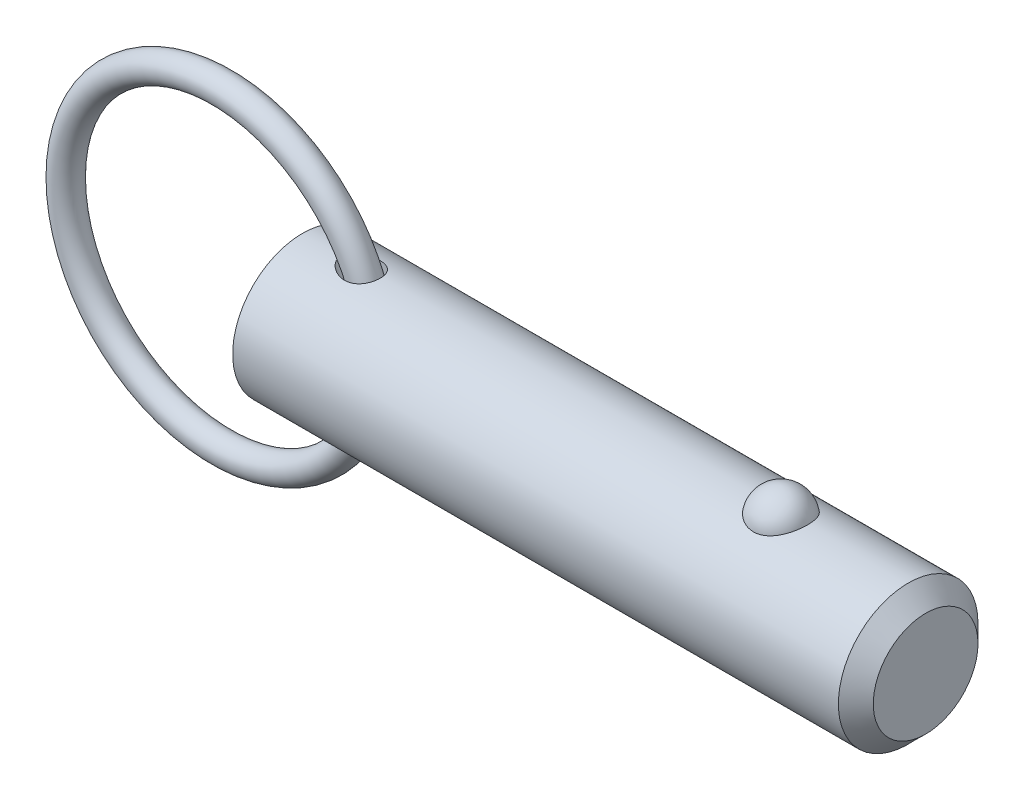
ISO-10303-21;
HEADER;
FILE_DESCRIPTION(('STEP AP214'),'2;1');
FILE_NAME('part.step','',(''),(''),'','','');
FILE_SCHEMA(('AUTOMOTIVE_DESIGN { 1 0 10303 214 1 1 1 1 }'));
ENDSEC;
DATA;
#1=APPLICATION_CONTEXT('core data for automotive mechanical design processes');
#2=APPLICATION_PROTOCOL_DEFINITION('international standard','automotive_design',2000,#1);
#3=PRODUCT_CONTEXT('',#1,'mechanical');
#4=PRODUCT('Part','Part','',(#3));
#5=PRODUCT_RELATED_PRODUCT_CATEGORY('part','',(#4));
#6=PRODUCT_DEFINITION_FORMATION('','',#4);
#7=PRODUCT_DEFINITION_CONTEXT('part definition',#1,'design');
#8=PRODUCT_DEFINITION('design','',#6,#7);
#9=PRODUCT_DEFINITION_SHAPE('','',#8);
#10=(LENGTH_UNIT() NAMED_UNIT(*) SI_UNIT(.MILLI.,.METRE.));
#11=(NAMED_UNIT(*) PLANE_ANGLE_UNIT() SI_UNIT($,.RADIAN.));
#12=(NAMED_UNIT(*) SI_UNIT($,.STERADIAN.) SOLID_ANGLE_UNIT());
#13=UNCERTAINTY_MEASURE_WITH_UNIT(LENGTH_MEASURE(1.E-05),#10,'distance_accuracy_value','');
#14=(GEOMETRIC_REPRESENTATION_CONTEXT(3) GLOBAL_UNCERTAINTY_ASSIGNED_CONTEXT((#13)) GLOBAL_UNIT_ASSIGNED_CONTEXT((#10,
#11,#12)) REPRESENTATION_CONTEXT('',''));
#15=CARTESIAN_POINT('',(0.,0.,0.));
#16=DIRECTION('',(0.,0.,1.));
#17=DIRECTION('',(1.,0.,0.));
#18=AXIS2_PLACEMENT_3D('',#15,#16,#17);
#19=CARTESIAN_POINT('',(-8.23730968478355,0.,0.));
#20=DIRECTION('',(0.,0.,1.));
#21=DIRECTION('',(1.,0.,0.));
#22=AXIS2_PLACEMENT_3D('',#19,#20,#21);
#23=TOROIDAL_SURFACE('',#22,15.875,1.422);
#24=CARTESIAN_POINT('',(9.05969031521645,0.,0.));
#25=VERTEX_POINT('',#24);
#26=VERTEX_LOOP('',#25);
#27=FACE_BOUND('',#26,.T.);
#28=ADVANCED_FACE('P0_F12',(#27),#23,.T.);
#29=CLOSED_SHELL('',(#28));
#30=MANIFOLD_SOLID_BREP('P0_B1',#29);
#31=CARTESIAN_POINT('',(0.,0.,0.));
#32=DIRECTION('',(1.,0.,0.));
#33=DIRECTION('',(0.,0.,-1.));
#34=AXIS2_PLACEMENT_3D('',#31,#32,#33);
#35=CYLINDRICAL_SURFACE('',#34,7.11);
#36=CARTESIAN_POINT('',(3.98467340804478,7.10072679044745,-0.363013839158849));
#37=CARTESIAN_POINT('',(4.00971652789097,7.09600153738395,-0.45539194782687));
#38=CARTESIAN_POINT('',(4.04401947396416,7.08958406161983,-0.545230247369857));
#39=CARTESIAN_POINT('',(4.12810160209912,7.07427055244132,-0.717157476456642));
#40=CARTESIAN_POINT('',(4.17791765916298,7.06536861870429,-0.799227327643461));
#41=CARTESIAN_POINT('',(4.28924471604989,7.04620300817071,-0.953469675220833));
#42=CARTESIAN_POINT('',(4.35063580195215,7.035953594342,-1.02573162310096));
#43=CARTESIAN_POINT('',(4.48282610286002,7.01493313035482,-1.16081412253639));
#44=CARTESIAN_POINT('',(4.55362244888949,7.00416223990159,-1.22363754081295));
#45=CARTESIAN_POINT('',(4.71659336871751,6.98090398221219,-1.35055080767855));
#46=CARTESIAN_POINT('',(4.81029272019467,6.96847103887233,-1.41269256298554));
#47=CARTESIAN_POINT('',(5.0057240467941,6.94515366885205,-1.52319699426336));
#48=CARTESIAN_POINT('',(5.10746392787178,6.93427079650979,-1.57154588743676));
#49=CARTESIAN_POINT('',(5.33503739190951,6.91346066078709,-1.66091325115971));
#50=CARTESIAN_POINT('',(5.46199550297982,6.90402388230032,-1.69921932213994));
#51=CARTESIAN_POINT('',(5.72084799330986,6.89024030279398,-1.75428261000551));
#52=CARTESIAN_POINT('',(5.85274301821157,6.88589416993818,-1.77103699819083));
#53=CARTESIAN_POINT('',(6.11557710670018,6.88337277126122,-1.78081990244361));
#54=CARTESIAN_POINT('',(6.24650031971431,6.88510489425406,-1.77420448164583));
#55=CARTESIAN_POINT('',(6.50446311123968,6.89478744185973,-1.73620392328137));
#56=CARTESIAN_POINT('',(6.6315075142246,6.90272978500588,-1.70485097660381));
#57=CARTESIAN_POINT('',(6.85933269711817,6.92243075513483,-1.62281888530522));
#58=CARTESIAN_POINT('',(6.96133251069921,6.93352131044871,-1.5753580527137));
#59=CARTESIAN_POINT('',(7.15436649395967,6.95824811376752,-1.46226310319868));
#60=CARTESIAN_POINT('',(7.24540699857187,6.97188287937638,-1.3966395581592));
#61=CARTESIAN_POINT('',(7.40446019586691,6.99838217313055,-1.25668991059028));
#62=CARTESIAN_POINT('',(7.473875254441,7.01118308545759,-1.18393777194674));
#63=CARTESIAN_POINT('',(7.59904891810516,7.03582803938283,-1.02736918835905));
#64=CARTESIAN_POINT('',(7.65481029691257,7.04767227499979,-0.943554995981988));
#65=CARTESIAN_POINT('',(7.74982438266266,7.06873077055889,-0.76979592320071));
#66=CARTESIAN_POINT('',(7.7894903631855,7.07800861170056,-0.680084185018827));
#67=CARTESIAN_POINT('',(7.85354088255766,7.09334756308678,-0.495102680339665));
#68=CARTESIAN_POINT('',(7.87792559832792,7.09940871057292,-0.399832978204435));
#69=CARTESIAN_POINT('',(7.9108898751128,7.10766731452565,-0.206294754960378));
#70=CARTESIAN_POINT('',(7.91944662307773,7.10985919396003,-0.108022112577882));
#71=CARTESIAN_POINT('',(7.920501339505,7.11012756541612,0.0886168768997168));
#72=CARTESIAN_POINT('',(7.91299895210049,7.10820396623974,0.186983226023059));
#73=CARTESIAN_POINT('',(7.88205794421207,7.10043733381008,0.381270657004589));
#74=CARTESIAN_POINT('',(7.85857985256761,7.09458459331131,0.477185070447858));
#75=CARTESIAN_POINT('',(7.79617406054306,7.07958431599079,0.663575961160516));
#76=CARTESIAN_POINT('',(7.75724672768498,7.07043685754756,0.754052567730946));
#77=CARTESIAN_POINT('',(7.66496731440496,7.04987259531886,0.926798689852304));
#78=CARTESIAN_POINT('',(7.61164530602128,7.0384605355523,1.00908483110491));
#79=CARTESIAN_POINT('',(7.49191707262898,7.01461776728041,1.16333092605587));
#80=CARTESIAN_POINT('',(7.42551210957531,7.00218715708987,1.235291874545));
#81=CARTESIAN_POINT('',(7.28164031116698,6.97770944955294,1.36680167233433));
#82=CARTESIAN_POINT('',(7.20420170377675,6.96566146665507,1.42638126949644));
#83=CARTESIAN_POINT('',(7.0403906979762,6.94319963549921,1.53199377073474));
#84=CARTESIAN_POINT('',(6.95401827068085,6.93278579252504,1.57802663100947));
#85=CARTESIAN_POINT('',(6.7731858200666,6.91444459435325,1.65656940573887));
#86=CARTESIAN_POINT('',(6.67860569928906,6.90656682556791,1.68881327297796));
#87=CARTESIAN_POINT('',(6.48544119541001,6.89422806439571,1.73849768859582));
#88=CARTESIAN_POINT('',(6.38685561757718,6.88976809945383,1.755933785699));
#89=CARTESIAN_POINT('',(6.18089829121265,6.88429907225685,1.77726234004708));
#90=CARTESIAN_POINT('',(6.07340937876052,6.88356485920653,1.78007646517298));
#91=CARTESIAN_POINT('',(5.85921220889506,6.886086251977,1.77029087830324));
#92=CARTESIAN_POINT('',(5.75250426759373,6.88934339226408,1.75768523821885));
#93=CARTESIAN_POINT('',(5.52848027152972,6.89994454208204,1.71563399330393));
#94=CARTESIAN_POINT('',(5.41155168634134,6.90775772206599,1.68424184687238));
#95=CARTESIAN_POINT('',(5.18376466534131,6.92670168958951,1.60454711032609));
#96=CARTESIAN_POINT('',(5.07291446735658,6.9378368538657,1.5562221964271));
#97=CARTESIAN_POINT('',(4.84835244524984,6.96347168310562,1.43744827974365));
#98=CARTESIAN_POINT('',(4.73562531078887,6.97820486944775,1.36517310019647));
#99=CARTESIAN_POINT('',(4.52504912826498,7.00822340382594,1.20158053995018));
#100=CARTESIAN_POINT('',(4.42717478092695,7.02350775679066,1.11029618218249));
#101=CARTESIAN_POINT('',(4.27935716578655,7.04784659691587,0.940654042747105));
#102=CARTESIAN_POINT('',(4.2239722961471,7.05736064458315,0.867099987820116));
#103=CARTESIAN_POINT('',(4.12558347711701,7.07469854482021,0.711919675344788));
#104=CARTESIAN_POINT('',(4.08256922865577,7.0825238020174,0.630300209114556));
#105=CARTESIAN_POINT('',(4.01142860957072,7.09565978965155,0.459428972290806));
#106=CARTESIAN_POINT('',(3.98346043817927,7.10094374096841,0.370107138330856));
#107=CARTESIAN_POINT('',(3.95517285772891,7.1063173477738,0.233358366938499));
#108=CARTESIAN_POINT('',(3.94802115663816,7.1076831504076,0.187321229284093));
#109=CARTESIAN_POINT('',(3.93842121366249,7.10951900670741,0.0947476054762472));
#110=CARTESIAN_POINT('',(3.93597129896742,7.10998937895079,0.0482113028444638));
#111=CARTESIAN_POINT('',(3.93584361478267,7.11001358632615,-0.0598597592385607));
#112=CARTESIAN_POINT('',(3.9399538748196,7.10922402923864,-0.121405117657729));
#113=CARTESIAN_POINT('',(3.95632793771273,7.10609781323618,-0.243320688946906));
#114=CARTESIAN_POINT('',(3.96859135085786,7.10376122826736,-0.303690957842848));
#115=CARTESIAN_POINT('',(3.98467340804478,7.10072679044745,-0.363013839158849));
#116=B_SPLINE_CURVE_WITH_KNOTS('',3,(#36,#37,#38,#39,#40,#41,#42,#43,#44,#45,#46,#47,#48,#49,
#50,#51,#52,#53,#54,#55,#56,#57,#58,#59,#60,#61,#62,#63,#64,#65,#66,#67,#68,#69,#70,#71,#72,#73,
#74,#75,#76,#77,#78,#79,#80,#81,#82,#83,#84,#85,#86,#87,#88,#89,#90,#91,#92,#93,#94,#95,#96,#97,
#98,#99,#100,#101,#102,#103,#104,#105,#106,#107,#108,#109,#110,#111,#112,#113,#114,#115),
.UNSPECIFIED.,.T.,.F.,(4,2,2,2,2,2,2,2,2,2,2,2,2,2,2,2,2,2,2,2,2,2,2,2,2,2,2,2,2,2,2,2,2,2,2,2,
2,2,2,4),(0.,0.287206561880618,0.575101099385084,0.860162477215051,1.14513709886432,
1.48324846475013,1.82169652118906,2.21865672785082,2.6156690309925,3.00665870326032,
3.39714041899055,3.73437585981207,4.07141541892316,4.37402271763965,4.67656849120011,
4.97076150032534,5.26495110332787,5.55956439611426,5.85418421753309,6.14953461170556,
6.44487798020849,6.73960905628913,7.03431171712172,7.32827352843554,7.6222362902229,
7.9216396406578,8.22113296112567,8.54242840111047,8.86384740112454,9.22635035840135,
9.58933304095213,9.99153142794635,10.3930368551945,10.6697219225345,10.9461759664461,
11.2254825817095,11.3650959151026,11.5046595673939,11.6891051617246,11.8735419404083),.UNSPECIFIED.);
#117=CARTESIAN_POINT('',(3.98467340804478,7.10072679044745,-0.363013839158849));
#118=VERTEX_POINT('',#117);
#119=EDGE_CURVE('P1_E40',#118,#118,#116,.T.);
#120=ORIENTED_EDGE('',*,*,#119,.T.);
#121=EDGE_LOOP('',(#120));
#122=FACE_BOUND('',#121,.T.);
#123=CARTESIAN_POINT('',(61.6925,0.,0.));
#124=DIRECTION('',(1.,0.,0.));
#125=DIRECTION('',(0.,0.,-1.));
#126=AXIS2_PLACEMENT_3D('',#123,#124,#125);
#127=CIRCLE('',#126,7.11);
#128=CARTESIAN_POINT('',(61.6925,0.,-7.11));
#129=VERTEX_POINT('',#128);
#130=EDGE_CURVE('P1_E25',#129,#129,#127,.T.);
#131=ORIENTED_EDGE('',*,*,#130,.F.);
#132=EDGE_LOOP('',(#131));
#133=FACE_BOUND('',#132,.T.);
#134=CARTESIAN_POINT('',(0.,0.,0.));
#135=DIRECTION('',(1.,0.,0.));
#136=DIRECTION('',(0.,0.,-1.));
#137=AXIS2_PLACEMENT_3D('',#134,#135,#136);
#138=CIRCLE('',#137,7.11);
#139=CARTESIAN_POINT('',(0.,0.,-7.11));
#140=VERTEX_POINT('',#139);
#141=EDGE_CURVE('P1_E9',#140,#140,#138,.T.);
#142=ORIENTED_EDGE('',*,*,#141,.T.);
#143=EDGE_LOOP('',(#142));
#144=FACE_BOUND('',#143,.T.);
#145=CARTESIAN_POINT('',(48.729258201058,6.5364666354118,2.79762469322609));
#146=CARTESIAN_POINT('',(48.5844296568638,6.53647876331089,2.79761243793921));
#147=CARTESIAN_POINT('',(48.439368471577,6.54144531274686,2.78608115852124));
#148=CARTESIAN_POINT('',(48.1532920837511,6.56077791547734,2.7402328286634));
#149=CARTESIAN_POINT('',(48.0122884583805,6.5751685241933,2.7058562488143));
#150=CARTESIAN_POINT('',(47.7388833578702,6.61165072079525,2.61544042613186));
#151=CARTESIAN_POINT('',(47.6064602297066,6.63372195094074,2.55945840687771));
#152=CARTESIAN_POINT('',(47.3532337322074,6.68316012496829,2.42742958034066));
#153=CARTESIAN_POINT('',(47.2324254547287,6.71052481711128,2.35139129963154));
#154=CARTESIAN_POINT('',(47.0016372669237,6.76860821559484,2.17866150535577));
#155=CARTESIAN_POINT('',(46.8920857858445,6.79940242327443,2.08142342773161));
#156=CARTESIAN_POINT('',(46.6903340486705,6.86050242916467,1.87020907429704));
#157=CARTESIAN_POINT('',(46.5981390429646,6.89080807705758,1.75622775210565));
#158=CARTESIAN_POINT('',(46.4292547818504,6.94923069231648,1.50900646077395));
#159=CARTESIAN_POINT('',(46.3534289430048,6.97719213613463,1.37513873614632));
#160=CARTESIAN_POINT('',(46.2242063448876,7.02647251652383,1.09584817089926));
#161=CARTESIAN_POINT('',(46.1708109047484,7.04779106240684,0.950424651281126));
#162=CARTESIAN_POINT('',(46.0871019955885,7.08180248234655,0.650508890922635));
#163=CARTESIAN_POINT('',(46.0570253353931,7.09440672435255,0.49594033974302));
#164=CARTESIAN_POINT('',(46.0214735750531,7.10935121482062,0.183515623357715));
#165=CARTESIAN_POINT('',(46.0159974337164,7.11169189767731,0.0256595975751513));
#166=CARTESIAN_POINT('',(46.029700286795,7.10589702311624,-0.287512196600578));
#167=CARTESIAN_POINT('',(46.0486823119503,7.0978451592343,-0.442838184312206));
#168=CARTESIAN_POINT('',(46.1105745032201,7.07221860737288,-0.747830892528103));
#169=CARTESIAN_POINT('',(46.1534850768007,7.05464375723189,-0.897497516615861));
#170=CARTESIAN_POINT('',(46.2624527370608,7.01171031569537,-1.18722864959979));
#171=CARTESIAN_POINT('',(46.3285458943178,6.98633960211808,-1.32727778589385));
#172=CARTESIAN_POINT('',(46.4825362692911,6.93042258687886,-1.59370324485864));
#173=CARTESIAN_POINT('',(46.5704355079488,6.89987580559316,-1.7200782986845));
#174=CARTESIAN_POINT('',(46.7669269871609,6.83659510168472,-1.95657345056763));
#175=CARTESIAN_POINT('',(46.8756640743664,6.80384697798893,-2.06656957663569));
#176=CARTESIAN_POINT('',(47.1109686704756,6.7400183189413,-2.26611005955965));
#177=CARTESIAN_POINT('',(47.2375350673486,6.70893767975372,-2.35565569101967));
#178=CARTESIAN_POINT('',(47.5028454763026,6.65264442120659,-2.51019726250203));
#179=CARTESIAN_POINT('',(47.6413230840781,6.62733449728,-2.57561395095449));
#180=CARTESIAN_POINT('',(47.9285194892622,6.58495995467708,-2.68211134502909));
#181=CARTESIAN_POINT('',(48.0772343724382,6.56789220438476,-2.7232012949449));
#182=CARTESIAN_POINT('',(48.3726268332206,6.54478663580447,-2.77825810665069));
#183=CARTESIAN_POINT('',(48.5190295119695,6.53823639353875,-2.79348727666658));
#184=CARTESIAN_POINT('',(48.8124700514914,6.53532718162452,-2.80028921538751));
#185=CARTESIAN_POINT('',(48.9595077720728,6.53896606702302,-2.79186696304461));
#186=CARTESIAN_POINT('',(49.2449210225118,6.55570357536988,-2.75232178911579));
#187=CARTESIAN_POINT('',(49.3834221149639,6.56848455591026,-2.72196077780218));
#188=CARTESIAN_POINT('',(49.6531142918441,6.60173528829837,-2.64028774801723));
#189=CARTESIAN_POINT('',(49.784304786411,6.62220565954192,-2.58897404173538));
#190=CARTESIAN_POINT('',(50.0388462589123,6.66917927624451,-2.4654782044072));
#191=CARTESIAN_POINT('',(50.1619691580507,6.69580233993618,-2.39287266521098));
#192=CARTESIAN_POINT('',(50.3944418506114,6.75207041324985,-2.2291526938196));
#193=CARTESIAN_POINT('',(50.5037884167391,6.78171612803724,-2.13803393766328));
#194=CARTESIAN_POINT('',(50.711642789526,6.84264629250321,-1.93445592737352));
#195=CARTESIAN_POINT('',(50.8093178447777,6.87393748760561,-1.82114774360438));
#196=CARTESIAN_POINT('',(50.9850112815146,6.93345710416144,-1.57947787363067));
#197=CARTESIAN_POINT('',(51.0630261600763,6.96168497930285,-1.45111351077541));
#198=CARTESIAN_POINT('',(51.1999857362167,7.01307558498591,-1.17842708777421));
#199=CARTESIAN_POINT('',(51.2582588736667,7.03605262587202,-1.03373189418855));
#200=CARTESIAN_POINT('',(51.3510815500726,7.07340932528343,-0.735867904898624));
#201=CARTESIAN_POINT('',(51.3856311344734,7.08778900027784,-0.582699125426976));
#202=CARTESIAN_POINT('',(51.4302742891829,7.10647639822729,-0.272420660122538));
#203=CARTESIAN_POINT('',(51.44039710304,7.11079616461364,-0.115315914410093));
#204=CARTESIAN_POINT('',(51.436061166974,7.10896059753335,0.198488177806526));
#205=CARTESIAN_POINT('',(51.4216031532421,7.10280557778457,0.355187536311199));
#206=CARTESIAN_POINT('',(51.3685727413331,7.08071500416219,0.662724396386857));
#207=CARTESIAN_POINT('',(51.3301505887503,7.06484039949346,0.813592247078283));
#208=CARTESIAN_POINT('',(51.230101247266,7.0249589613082,1.10629159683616));
#209=CARTESIAN_POINT('',(51.1684724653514,7.00095156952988,1.24812247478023));
#210=CARTESIAN_POINT('',(51.0227668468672,6.94706632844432,1.51976439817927));
#211=CARTESIAN_POINT('',(50.9385448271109,6.91715085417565,1.64949012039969));
#212=CARTESIAN_POINT('',(50.7495861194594,6.85470565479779,1.89231285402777));
#213=CARTESIAN_POINT('',(50.6448501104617,6.82217601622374,2.00541041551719));
#214=CARTESIAN_POINT('',(50.4171030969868,6.75805358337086,2.21190674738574));
#215=CARTESIAN_POINT('',(50.294082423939,6.72646129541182,2.30529503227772));
#216=CARTESIAN_POINT('',(50.0327347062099,6.66789520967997,2.46959908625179));
#217=CARTESIAN_POINT('',(49.8944019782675,6.64092313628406,2.54050647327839));
#218=CARTESIAN_POINT('',(49.6111828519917,6.5957258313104,2.65560045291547));
#219=CARTESIAN_POINT('',(49.4666660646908,6.57724013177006,2.70059539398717));
#220=CARTESIAN_POINT('',(49.1715469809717,6.55006426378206,2.76587321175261));
#221=CARTESIAN_POINT('',(49.0209640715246,6.54134511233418,2.78622922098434));
#222=CARTESIAN_POINT('',(48.8230463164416,6.53697847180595,2.7964243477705));
#223=CARTESIAN_POINT('',(48.7761644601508,6.53646270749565,2.79762866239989));
#224=CARTESIAN_POINT('',(48.729258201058,6.5364666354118,2.79762469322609));
#225=B_SPLINE_CURVE_WITH_KNOTS('',3,(#145,#146,#147,#148,#149,#150,#151,#152,#153,#154,#155,
#156,#157,#158,#159,#160,#161,#162,#163,#164,#165,#166,#167,#168,#169,#170,#171,#172,#173,#174,
#175,#176,#177,#178,#179,#180,#181,#182,#183,#184,#185,#186,#187,#188,#189,#190,#191,#192,#193,
#194,#195,#196,#197,#198,#199,#200,#201,#202,#203,#204,#205,#206,#207,#208,#209,#210,#211,#212,
#213,#214,#215,#216,#217,#218,#219,#220,#221,#222,#223,#224),.UNSPECIFIED.,.T.,.F.,(4,2,2,2,2,2,
2,2,2,2,2,2,2,2,2,2,2,2,2,2,2,2,2,2,2,2,2,2,2,2,2,2,2,2,2,2,2,2,2,4),(0.,0.434355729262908,
0.869847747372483,1.30419416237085,1.73835621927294,2.18541922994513,2.63261726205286,
3.09954261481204,3.56649542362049,4.03813031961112,4.50974525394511,4.97758575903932,
5.44543423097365,5.9140138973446,6.38263700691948,6.8546441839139,7.32662193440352,
7.78992971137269,8.25306131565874,8.69285754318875,9.13256119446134,9.55768625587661,
9.9828455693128,10.4171106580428,10.8514772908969,11.3079089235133,11.7644218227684,
12.2351898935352,12.7059570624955,13.1761603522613,13.6463495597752,14.1136200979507,
14.580922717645,15.0513032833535,15.5216682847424,15.9922828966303,16.4630727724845,
16.9182457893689,17.3720644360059,17.5127411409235),.UNSPECIFIED.);
#226=CARTESIAN_POINT('',(48.729258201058,6.5364666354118,2.79762469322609));
#227=VERTEX_POINT('',#226);
#228=EDGE_CURVE('P1_E34',#227,#227,#225,.T.);
#229=ORIENTED_EDGE('',*,*,#228,.T.);
#230=EDGE_LOOP('',(#229));
#231=FACE_BOUND('',#230,.T.);
#232=CARTESIAN_POINT('',(3.98467340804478,-7.10072679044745,-0.363013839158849));
#233=CARTESIAN_POINT('',(3.96426456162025,-7.10457733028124,-0.287714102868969));
#234=CARTESIAN_POINT('',(3.95000501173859,-7.10730349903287,-0.210695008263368));
#235=CARTESIAN_POINT('',(3.93481801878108,-7.11020840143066,-0.0553038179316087));
#236=CARTESIAN_POINT('',(3.93388435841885,-7.11038832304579,0.0230676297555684));
#237=CARTESIAN_POINT('',(3.94541910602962,-7.10817995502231,0.178714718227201));
#238=CARTESIAN_POINT('',(3.95787987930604,-7.10579312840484,0.25599095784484));
#239=CARTESIAN_POINT('',(3.99523775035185,-7.09872642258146,0.407352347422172));
#240=CARTESIAN_POINT('',(4.02014065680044,-7.09404547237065,0.481435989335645));
#241=CARTESIAN_POINT('',(4.08119600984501,-7.08278363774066,0.625775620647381));
#242=CARTESIAN_POINT('',(4.11749458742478,-7.07617815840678,0.695967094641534));
#243=CARTESIAN_POINT('',(4.19940836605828,-7.06165305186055,0.830508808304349));
#244=CARTESIAN_POINT('',(4.24502952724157,-7.0537325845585,0.894855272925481));
#245=CARTESIAN_POINT('',(4.36790232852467,-7.03310314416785,1.04688574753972));
#246=CARTESIAN_POINT('',(4.44977459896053,-7.01993229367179,1.13078695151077));
#247=CARTESIAN_POINT('',(4.62610796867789,-6.99351259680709,1.28411726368));
#248=CARTESIAN_POINT('',(4.7205898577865,-6.98026365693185,1.35352197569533));
#249=CARTESIAN_POINT('',(4.92036507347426,-6.9549104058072,1.47831921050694));
#250=CARTESIAN_POINT('',(5.02579054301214,-6.94282458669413,1.53350332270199));
#251=CARTESIAN_POINT('',(5.24378330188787,-6.92129098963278,1.62793610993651));
#252=CARTESIAN_POINT('',(5.35635066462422,-6.91184323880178,1.66718462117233));
#253=CARTESIAN_POINT('',(5.60134354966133,-6.89573491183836,1.73269893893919));
#254=CARTESIAN_POINT('',(5.73444697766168,-6.8895970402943,1.75661057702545));
#255=CARTESIAN_POINT('',(6.00300738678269,-6.88344616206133,1.78057487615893));
#256=CARTESIAN_POINT('',(6.13846360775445,-6.88343121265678,1.78063510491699));
#257=CARTESIAN_POINT('',(6.39660470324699,-6.88981379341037,1.75576480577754));
#258=CARTESIAN_POINT('',(6.51947843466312,-6.89572457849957,1.73273121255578));
#259=CARTESIAN_POINT('',(6.75813770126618,-6.91274434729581,1.66352936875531));
#260=CARTESIAN_POINT('',(6.87393155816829,-6.92384709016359,1.61738888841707));
#261=CARTESIAN_POINT('',(7.07801861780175,-6.94787316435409,1.51052664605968));
#262=CARTESIAN_POINT('',(7.16789841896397,-6.96033024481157,1.45271574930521));
#263=CARTESIAN_POINT('',(7.33546773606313,-6.98638661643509,1.32171912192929));
#264=CARTESIAN_POINT('',(7.41316182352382,-6.99998547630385,1.24853918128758));
#265=CARTESIAN_POINT('',(7.54861420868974,-7.02559503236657,1.09486170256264));
#266=CARTESIAN_POINT('',(7.60741145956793,-7.03764930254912,1.01528346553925));
#267=CARTESIAN_POINT('',(7.71070740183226,-7.0598657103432,0.847099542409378));
#268=CARTESIAN_POINT('',(7.75520788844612,-7.0700280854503,0.758494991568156));
#269=CARTESIAN_POINT('',(7.82836147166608,-7.08722075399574,0.575936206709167));
#270=CARTESIAN_POINT('',(7.85719783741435,-7.09428707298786,0.482058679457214));
#271=CARTESIAN_POINT('',(7.89918378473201,-7.10470260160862,0.29065874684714));
#272=CARTESIAN_POINT('',(7.91233308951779,-7.10805174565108,0.193136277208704));
#273=CARTESIAN_POINT('',(7.92267451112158,-7.11067890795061,-0.00313968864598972));
#274=CARTESIAN_POINT('',(7.91981203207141,-7.10994299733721,-0.10189624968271));
#275=CARTESIAN_POINT('',(7.89806489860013,-7.10444651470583,-0.297516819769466));
#276=CARTESIAN_POINT('',(7.87918005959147,-7.09968589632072,-0.394380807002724));
#277=CARTESIAN_POINT('',(7.82577988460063,-7.0866471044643,-0.58355375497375));
#278=CARTESIAN_POINT('',(7.79124976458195,-7.07836560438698,-0.675858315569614));
#279=CARTESIAN_POINT('',(7.70736343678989,-7.05919003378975,-0.853167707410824));
#280=CARTESIAN_POINT('',(7.65800801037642,-7.04829610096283,-0.938172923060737));
#281=CARTESIAN_POINT('',(7.54590141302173,-7.02513961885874,-1.09819812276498));
#282=CARTESIAN_POINT('',(7.48319521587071,-7.01288172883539,-1.17325029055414));
#283=CARTESIAN_POINT('',(7.34599775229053,-6.98832192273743,-1.31164333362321));
#284=CARTESIAN_POINT('',(7.27150757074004,-6.97602001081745,-1.37498528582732));
#285=CARTESIAN_POINT('',(7.11277776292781,-6.95268608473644,-1.48849974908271));
#286=CARTESIAN_POINT('',(7.02852525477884,-6.94165578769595,-1.53865456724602));
#287=CARTESIAN_POINT('',(6.85282430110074,-6.92200320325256,-1.62478650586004));
#288=CARTESIAN_POINT('',(6.76137511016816,-6.91338116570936,-1.66076215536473));
#289=CARTESIAN_POINT('',(6.57061179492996,-6.89906044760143,-1.71930563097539));
#290=CARTESIAN_POINT('',(6.47113516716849,-6.89347290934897,-1.74136795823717));
#291=CARTESIAN_POINT('',(6.26989833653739,-6.88605020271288,-1.7704895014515));
#292=CARTESIAN_POINT('',(6.16813737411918,-6.88421630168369,-1.77754365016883));
#293=CARTESIAN_POINT('',(5.95492537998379,-6.88424071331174,-1.77745174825));
#294=CARTESIAN_POINT('',(5.8434768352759,-6.88646827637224,-1.76888555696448));
#295=CARTESIAN_POINT('',(5.62307560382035,-6.89483827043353,-1.73596677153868));
#296=CARTESIAN_POINT('',(5.51412477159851,-6.90098351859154,-1.71160281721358));
#297=CARTESIAN_POINT('',(5.28644478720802,-6.91743803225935,-1.64393691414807));
#298=CARTESIAN_POINT('',(5.16837217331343,-6.92819628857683,-1.59852806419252));
#299=CARTESIAN_POINT('',(4.94091825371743,-6.95234836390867,-1.4899796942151));
#300=CARTESIAN_POINT('',(4.83153887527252,-6.96574276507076,-1.42683625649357));
#301=CARTESIAN_POINT('',(4.63576710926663,-6.99209234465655,-1.29112257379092));
#302=CARTESIAN_POINT('',(4.54816728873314,-7.00494184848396,-1.22027748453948));
#303=CARTESIAN_POINT('',(4.38554897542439,-7.03019055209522,-1.0652111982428));
#304=CARTESIAN_POINT('',(4.31052141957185,-7.04259007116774,-0.980999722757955));
#305=CARTESIAN_POINT('',(4.18551811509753,-7.0640229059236,-0.811206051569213));
#306=CARTESIAN_POINT('',(4.13358417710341,-7.07328321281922,-0.727107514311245));
#307=CARTESIAN_POINT('',(4.04607461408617,-7.0891994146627,-0.550580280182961));
#308=CARTESIAN_POINT('',(4.01046401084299,-7.09586087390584,-0.458169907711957));
#309=CARTESIAN_POINT('',(3.98467340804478,-7.10072679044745,-0.363013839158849));
#310=B_SPLINE_CURVE_WITH_KNOTS('',3,(#232,#233,#234,#235,#236,#237,#238,#239,#240,#241,#242,
#243,#244,#245,#246,#247,#248,#249,#250,#251,#252,#253,#254,#255,#256,#257,#258,#259,#260,#261,
#262,#263,#264,#265,#266,#267,#268,#269,#270,#271,#272,#273,#274,#275,#276,#277,#278,#279,#280,
#281,#282,#283,#284,#285,#286,#287,#288,#289,#290,#291,#292,#293,#294,#295,#296,#297,#298,#299,
#300,#301,#302,#303,#304,#305,#306,#307,#308,#309),.UNSPECIFIED.,.T.,.F.,(4,2,2,2,2,2,2,2,2,2,2,
2,2,2,2,2,2,2,2,2,2,2,2,2,2,2,2,2,2,2,2,2,2,2,2,2,2,2,4),(0.,0.23402065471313,0.467932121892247,
0.701710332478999,0.935597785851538,1.17261620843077,1.40978663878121,1.76177576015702,
2.11435255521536,2.47183528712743,2.8293216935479,3.23332937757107,3.63720887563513,
4.01042610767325,4.38319587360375,4.70425151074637,5.02518641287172,5.32277979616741,
5.62033579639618,5.91433101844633,6.2083314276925,6.50333490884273,6.79834178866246,
7.09362801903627,7.38889868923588,7.6831900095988,7.9774542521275,8.27211131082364,
8.56679892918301,8.8716552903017,9.17661456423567,9.51069129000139,9.84500851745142,
10.2243046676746,10.6036846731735,10.9425776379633,11.2812252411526,11.5775945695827,
11.8733258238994),.UNSPECIFIED.);
#311=CARTESIAN_POINT('',(3.98467340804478,-7.10072679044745,-0.363013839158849));
#312=VERTEX_POINT('',#311);
#313=EDGE_CURVE('P1_E17',#312,#312,#310,.T.);
#314=ORIENTED_EDGE('',*,*,#313,.T.);
#315=EDGE_LOOP('',(#314));
#316=FACE_BOUND('',#315,.T.);
#317=ADVANCED_FACE('P1_F13',(#122,#133,#144,#231,#316),#35,.T.);
#318=CARTESIAN_POINT('',(0.,0.,0.));
#319=DIRECTION('',(-1.,0.,0.));
#320=DIRECTION('',(0.,0.,1.));
#321=AXIS2_PLACEMENT_3D('',#318,#319,#320);
#322=PLANE('',#321);
#323=ORIENTED_EDGE('',*,*,#141,.F.);
#324=EDGE_LOOP('',(#323));
#325=FACE_BOUND('',#324,.T.);
#326=ADVANCED_FACE('P1_F15',(#325),#322,.T.);
#327=CARTESIAN_POINT('',(63.47,0.,0.));
#328=DIRECTION('',(-1.,0.,0.));
#329=DIRECTION('',(0.,0.,1.));
#330=AXIS2_PLACEMENT_3D('',#327,#328,#329);
#331=CONICAL_SURFACE('',#330,5.33250000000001,0.785398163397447);
#332=ORIENTED_EDGE('',*,*,#130,.T.);
#333=EDGE_LOOP('',(#332));
#334=FACE_BOUND('',#333,.T.);
#335=CARTESIAN_POINT('',(63.47,0.,0.));
#336=DIRECTION('',(1.,0.,0.));
#337=DIRECTION('',(0.,0.,-1.));
#338=AXIS2_PLACEMENT_3D('',#335,#336,#337);
#339=CIRCLE('',#338,5.33250000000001);
#340=CARTESIAN_POINT('',(63.47,0.,-5.33250000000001));
#341=VERTEX_POINT('',#340);
#342=EDGE_CURVE('P1_E30',#341,#341,#339,.T.);
#343=ORIENTED_EDGE('',*,*,#342,.F.);
#344=EDGE_LOOP('',(#343));
#345=FACE_BOUND('',#344,.T.);
#346=ADVANCED_FACE('P1_F55',(#334,#345),#331,.T.);
#347=CARTESIAN_POINT('',(63.47,5.33250000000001,0.));
#348=DIRECTION('',(1.,0.,0.));
#349=DIRECTION('',(0.,0.,-1.));
#350=AXIS2_PLACEMENT_3D('',#347,#348,#349);
#351=PLANE('',#350);
#352=ORIENTED_EDGE('',*,*,#342,.T.);
#353=EDGE_LOOP('',(#352));
#354=FACE_BOUND('',#353,.T.);
#355=ADVANCED_FACE('P1_F51',(#354),#351,.T.);
#356=CARTESIAN_POINT('',(48.729258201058,6.399,0.));
#357=DIRECTION('',(-1.,0.,0.));
#358=DIRECTION('',(0.,1.,0.));
#359=AXIS2_PLACEMENT_3D('',#356,#357,#358);
#360=SPHERICAL_SURFACE('',#359,2.80099999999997);
#361=ORIENTED_EDGE('',*,*,#228,.F.);
#362=EDGE_LOOP('',(#361));
#363=FACE_BOUND('',#362,.T.);
#364=ADVANCED_FACE('P1_F46',(#363),#360,.T.);
#365=CARTESIAN_POINT('',(-8.23730968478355,0.,0.));
#366=DIRECTION('',(0.,0.,1.));
#367=DIRECTION('',(1.,0.,0.));
#368=AXIS2_PLACEMENT_3D('',#365,#366,#367);
#369=TOROIDAL_SURFACE('',#368,15.875,1.7775);
#370=ORIENTED_EDGE('',*,*,#313,.F.);
#371=EDGE_LOOP('',(#370));
#372=FACE_BOUND('',#371,.T.);
#373=ORIENTED_EDGE('',*,*,#119,.F.);
#374=EDGE_LOOP('',(#373));
#375=FACE_BOUND('',#374,.T.);
#376=ADVANCED_FACE('P1_F50',(#372,#375),#369,.F.);
#377=CLOSED_SHELL('',(#317,#326,#346,#355,#364,#376));
#378=MANIFOLD_SOLID_BREP('P1_B1',#377);
#379=ADVANCED_BREP_SHAPE_REPRESENTATION('',(#18,#30,#378),#14);
#380=SHAPE_DEFINITION_REPRESENTATION(#9,#379);
ENDSEC;
END-ISO-10303-21;
